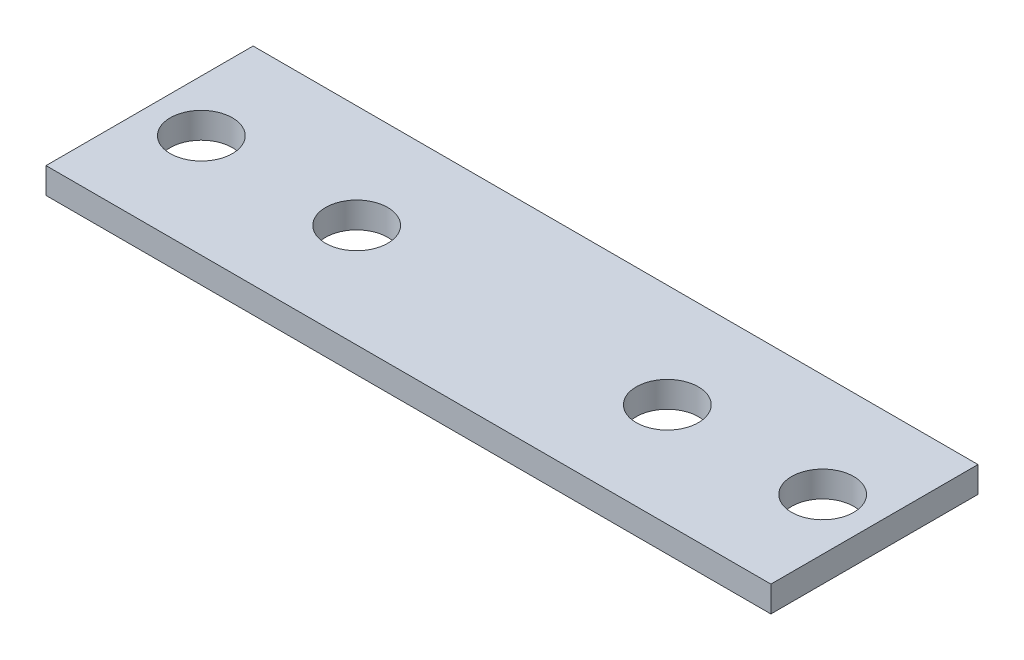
ISO-10303-21;
HEADER;
FILE_DESCRIPTION(('STEP AP214'),'2;1');
FILE_NAME('part.step','',(''),(''),'','','');
FILE_SCHEMA(('AUTOMOTIVE_DESIGN { 1 0 10303 214 1 1 1 1 }'));
ENDSEC;
DATA;
#1=APPLICATION_CONTEXT('core data for automotive mechanical design processes');
#2=APPLICATION_PROTOCOL_DEFINITION('international standard','automotive_design',2000,#1);
#3=PRODUCT_CONTEXT('',#1,'mechanical');
#4=PRODUCT('Part','Part','',(#3));
#5=PRODUCT_RELATED_PRODUCT_CATEGORY('part','',(#4));
#6=PRODUCT_DEFINITION_FORMATION('','',#4);
#7=PRODUCT_DEFINITION_CONTEXT('part definition',#1,'design');
#8=PRODUCT_DEFINITION('design','',#6,#7);
#9=PRODUCT_DEFINITION_SHAPE('','',#8);
#10=(LENGTH_UNIT() NAMED_UNIT(*) SI_UNIT(.MILLI.,.METRE.));
#11=(NAMED_UNIT(*) PLANE_ANGLE_UNIT() SI_UNIT($,.RADIAN.));
#12=(NAMED_UNIT(*) SI_UNIT($,.STERADIAN.) SOLID_ANGLE_UNIT());
#13=UNCERTAINTY_MEASURE_WITH_UNIT(LENGTH_MEASURE(1.E-05),#10,'distance_accuracy_value','');
#14=(GEOMETRIC_REPRESENTATION_CONTEXT(3) GLOBAL_UNCERTAINTY_ASSIGNED_CONTEXT((#13)) GLOBAL_UNIT_ASSIGNED_CONTEXT((#10,
#11,#12)) REPRESENTATION_CONTEXT('',''));
#15=CARTESIAN_POINT('',(0.,0.,0.));
#16=DIRECTION('',(0.,0.,1.));
#17=DIRECTION('',(1.,0.,0.));
#18=AXIS2_PLACEMENT_3D('',#15,#16,#17);
#19=CARTESIAN_POINT('',(0.,5.,-40.));
#20=DIRECTION('',(0.,-1.,0.));
#21=DIRECTION('',(0.,0.,-1.));
#22=AXIS2_PLACEMENT_3D('',#19,#20,#21);
#23=PLANE('',#22);
#24=CARTESIAN_POINT('',(40.,5.,-20.));
#25=DIRECTION('',(0.,1.,0.));
#26=DIRECTION('',(0.,0.,1.));
#27=AXIS2_PLACEMENT_3D('',#24,#25,#26);
#28=CIRCLE('',#27,6.00000000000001);
#29=CARTESIAN_POINT('',(40.,5.,-14.));
#30=VERTEX_POINT('',#29);
#31=EDGE_CURVE('E128',#30,#30,#28,.T.);
#32=ORIENTED_EDGE('',*,*,#31,.F.);
#33=EDGE_LOOP('',(#32));
#34=FACE_BOUND('',#33,.T.);
#35=CARTESIAN_POINT('',(10.,5.,-20.));
#36=DIRECTION('',(0.,1.,0.));
#37=DIRECTION('',(0.,0.,1.));
#38=AXIS2_PLACEMENT_3D('',#35,#36,#37);
#39=CIRCLE('',#38,6.);
#40=CARTESIAN_POINT('',(10.,5.,-14.));
#41=VERTEX_POINT('',#40);
#42=EDGE_CURVE('E90',#41,#41,#39,.T.);
#43=ORIENTED_EDGE('',*,*,#42,.F.);
#44=EDGE_LOOP('',(#43));
#45=FACE_BOUND('',#44,.T.);
#46=DIRECTION('',(0.,0.,1.));
#47=VECTOR('',#46,1.);
#48=CARTESIAN_POINT('',(0.,5.,0.));
#49=LINE('',#48,#47);
#50=CARTESIAN_POINT('',(0.,5.,-40.));
#51=VERTEX_POINT('',#50);
#52=CARTESIAN_POINT('',(0.,5.,0.));
#53=VERTEX_POINT('',#52);
#54=EDGE_CURVE('E100',#51,#53,#49,.T.);
#55=ORIENTED_EDGE('',*,*,#54,.T.);
#56=DIRECTION('',(1.,0.,0.));
#57=VECTOR('',#56,1.);
#58=CARTESIAN_POINT('',(0.,5.,0.));
#59=LINE('',#58,#57);
#60=CARTESIAN_POINT('',(140.,5.,0.));
#61=VERTEX_POINT('',#60);
#62=EDGE_CURVE('E85',#53,#61,#59,.T.);
#63=ORIENTED_EDGE('',*,*,#62,.T.);
#64=DIRECTION('',(0.,0.,-1.));
#65=VECTOR('',#64,1.);
#66=CARTESIAN_POINT('',(140.,5.,0.));
#67=LINE('',#66,#65);
#68=CARTESIAN_POINT('',(140.,5.,-40.));
#69=VERTEX_POINT('',#68);
#70=EDGE_CURVE('E51',#61,#69,#67,.T.);
#71=ORIENTED_EDGE('',*,*,#70,.T.);
#72=DIRECTION('',(-1.,0.,0.));
#73=VECTOR('',#72,1.);
#74=CARTESIAN_POINT('',(0.,5.,-40.));
#75=LINE('',#74,#73);
#76=EDGE_CURVE('E46',#69,#51,#75,.T.);
#77=ORIENTED_EDGE('',*,*,#76,.T.);
#78=EDGE_LOOP('',(#55,#63,#71,#77));
#79=FACE_BOUND('',#78,.T.);
#80=CARTESIAN_POINT('',(130.,5.,-20.));
#81=DIRECTION('',(0.,1.,0.));
#82=DIRECTION('',(0.,0.,1.));
#83=AXIS2_PLACEMENT_3D('',#80,#81,#82);
#84=CIRCLE('',#83,6.00000000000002);
#85=CARTESIAN_POINT('',(130.,5.,-14.));
#86=VERTEX_POINT('',#85);
#87=EDGE_CURVE('E119',#86,#86,#84,.T.);
#88=ORIENTED_EDGE('',*,*,#87,.F.);
#89=EDGE_LOOP('',(#88));
#90=FACE_BOUND('',#89,.T.);
#91=CARTESIAN_POINT('',(100.,5.,-20.));
#92=DIRECTION('',(0.,1.,0.));
#93=DIRECTION('',(0.,0.,1.));
#94=AXIS2_PLACEMENT_3D('',#91,#92,#93);
#95=CIRCLE('',#94,6.);
#96=CARTESIAN_POINT('',(100.,5.,-14.));
#97=VERTEX_POINT('',#96);
#98=EDGE_CURVE('E122',#97,#97,#95,.T.);
#99=ORIENTED_EDGE('',*,*,#98,.F.);
#100=EDGE_LOOP('',(#99));
#101=FACE_BOUND('',#100,.T.);
#102=ADVANCED_FACE('F31',(#34,#45,#79,#90,#101),#23,.F.);
#103=CARTESIAN_POINT('',(0.,0.,-40.));
#104=DIRECTION('',(0.,-1.,0.));
#105=DIRECTION('',(0.,0.,-1.));
#106=AXIS2_PLACEMENT_3D('',#103,#104,#105);
#107=PLANE('',#106);
#108=CARTESIAN_POINT('',(40.,0.,-20.));
#109=DIRECTION('',(0.,1.,0.));
#110=DIRECTION('',(0.,0.,1.));
#111=AXIS2_PLACEMENT_3D('',#108,#109,#110);
#112=CIRCLE('',#111,6.00000000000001);
#113=CARTESIAN_POINT('',(40.,0.,-14.));
#114=VERTEX_POINT('',#113);
#115=EDGE_CURVE('E124',#114,#114,#112,.T.);
#116=ORIENTED_EDGE('',*,*,#115,.T.);
#117=EDGE_LOOP('',(#116));
#118=FACE_BOUND('',#117,.T.);
#119=CARTESIAN_POINT('',(10.,0.,-20.));
#120=DIRECTION('',(0.,1.,0.));
#121=DIRECTION('',(0.,0.,1.));
#122=AXIS2_PLACEMENT_3D('',#119,#120,#121);
#123=CIRCLE('',#122,6.);
#124=CARTESIAN_POINT('',(10.,0.,-14.));
#125=VERTEX_POINT('',#124);
#126=EDGE_CURVE('E93',#125,#125,#123,.T.);
#127=ORIENTED_EDGE('',*,*,#126,.T.);
#128=EDGE_LOOP('',(#127));
#129=FACE_BOUND('',#128,.T.);
#130=DIRECTION('',(0.,0.,1.));
#131=VECTOR('',#130,1.);
#132=CARTESIAN_POINT('',(0.,0.,0.));
#133=LINE('',#132,#131);
#134=CARTESIAN_POINT('',(0.,0.,-40.));
#135=VERTEX_POINT('',#134);
#136=CARTESIAN_POINT('',(0.,0.,0.));
#137=VERTEX_POINT('',#136);
#138=EDGE_CURVE('E77',#135,#137,#133,.T.);
#139=ORIENTED_EDGE('',*,*,#138,.F.);
#140=DIRECTION('',(-1.,0.,0.));
#141=VECTOR('',#140,1.);
#142=CARTESIAN_POINT('',(0.,0.,-40.));
#143=LINE('',#142,#141);
#144=CARTESIAN_POINT('',(140.,0.,-40.));
#145=VERTEX_POINT('',#144);
#146=EDGE_CURVE('E98',#145,#135,#143,.T.);
#147=ORIENTED_EDGE('',*,*,#146,.F.);
#148=DIRECTION('',(0.,0.,-1.));
#149=VECTOR('',#148,1.);
#150=CARTESIAN_POINT('',(140.,0.,0.));
#151=LINE('',#150,#149);
#152=CARTESIAN_POINT('',(140.,0.,0.));
#153=VERTEX_POINT('',#152);
#154=EDGE_CURVE('E78',#153,#145,#151,.T.);
#155=ORIENTED_EDGE('',*,*,#154,.F.);
#156=DIRECTION('',(1.,0.,0.));
#157=VECTOR('',#156,1.);
#158=CARTESIAN_POINT('',(0.,0.,0.));
#159=LINE('',#158,#157);
#160=EDGE_CURVE('E72',#137,#153,#159,.T.);
#161=ORIENTED_EDGE('',*,*,#160,.F.);
#162=EDGE_LOOP('',(#139,#147,#155,#161));
#163=FACE_BOUND('',#162,.T.);
#164=CARTESIAN_POINT('',(130.,0.,-20.));
#165=DIRECTION('',(0.,1.,0.));
#166=DIRECTION('',(0.,0.,1.));
#167=AXIS2_PLACEMENT_3D('',#164,#165,#166);
#168=CIRCLE('',#167,6.00000000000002);
#169=CARTESIAN_POINT('',(130.,0.,-14.));
#170=VERTEX_POINT('',#169);
#171=EDGE_CURVE('E135',#170,#170,#168,.T.);
#172=ORIENTED_EDGE('',*,*,#171,.T.);
#173=EDGE_LOOP('',(#172));
#174=FACE_BOUND('',#173,.T.);
#175=CARTESIAN_POINT('',(100.,0.,-20.));
#176=DIRECTION('',(0.,1.,0.));
#177=DIRECTION('',(0.,0.,1.));
#178=AXIS2_PLACEMENT_3D('',#175,#176,#177);
#179=CIRCLE('',#178,6.);
#180=CARTESIAN_POINT('',(100.,0.,-14.));
#181=VERTEX_POINT('',#180);
#182=EDGE_CURVE('E125',#181,#181,#179,.T.);
#183=ORIENTED_EDGE('',*,*,#182,.T.);
#184=EDGE_LOOP('',(#183));
#185=FACE_BOUND('',#184,.T.);
#186=ADVANCED_FACE('F73',(#118,#129,#163,#174,#185),#107,.T.);
#187=CARTESIAN_POINT('',(0.,5.,0.));
#188=DIRECTION('',(1.,0.,0.));
#189=DIRECTION('',(0.,0.,-1.));
#190=AXIS2_PLACEMENT_3D('',#187,#188,#189);
#191=PLANE('',#190);
#192=ORIENTED_EDGE('',*,*,#138,.T.);
#193=DIRECTION('',(0.,-1.,0.));
#194=VECTOR('',#193,1.);
#195=CARTESIAN_POINT('',(0.,5.,0.));
#196=LINE('',#195,#194);
#197=EDGE_CURVE('E11',#53,#137,#196,.T.);
#198=ORIENTED_EDGE('',*,*,#197,.F.);
#199=ORIENTED_EDGE('',*,*,#54,.F.);
#200=DIRECTION('',(0.,-1.,0.));
#201=VECTOR('',#200,1.);
#202=CARTESIAN_POINT('',(0.,5.,-40.));
#203=LINE('',#202,#201);
#204=EDGE_CURVE('E89',#51,#135,#203,.T.);
#205=ORIENTED_EDGE('',*,*,#204,.T.);
#206=EDGE_LOOP('',(#192,#198,#199,#205));
#207=FACE_BOUND('',#206,.T.);
#208=ADVANCED_FACE('F33',(#207),#191,.F.);
#209=CARTESIAN_POINT('',(0.,5.,0.));
#210=DIRECTION('',(0.,0.,-1.));
#211=DIRECTION('',(-1.,0.,0.));
#212=AXIS2_PLACEMENT_3D('',#209,#210,#211);
#213=PLANE('',#212);
#214=ORIENTED_EDGE('',*,*,#160,.T.);
#215=DIRECTION('',(0.,-1.,0.));
#216=VECTOR('',#215,1.);
#217=CARTESIAN_POINT('',(140.,5.,0.));
#218=LINE('',#217,#216);
#219=EDGE_CURVE('E39',#61,#153,#218,.T.);
#220=ORIENTED_EDGE('',*,*,#219,.F.);
#221=ORIENTED_EDGE('',*,*,#62,.F.);
#222=ORIENTED_EDGE('',*,*,#197,.T.);
#223=EDGE_LOOP('',(#214,#220,#221,#222));
#224=FACE_BOUND('',#223,.T.);
#225=ADVANCED_FACE('F84',(#224),#213,.F.);
#226=CARTESIAN_POINT('',(140.,5.,0.));
#227=DIRECTION('',(-1.,0.,0.));
#228=DIRECTION('',(0.,0.,1.));
#229=AXIS2_PLACEMENT_3D('',#226,#227,#228);
#230=PLANE('',#229);
#231=ORIENTED_EDGE('',*,*,#154,.T.);
#232=DIRECTION('',(0.,-1.,0.));
#233=VECTOR('',#232,1.);
#234=CARTESIAN_POINT('',(140.,5.,-40.));
#235=LINE('',#234,#233);
#236=EDGE_CURVE('E106',#69,#145,#235,.T.);
#237=ORIENTED_EDGE('',*,*,#236,.F.);
#238=ORIENTED_EDGE('',*,*,#70,.F.);
#239=ORIENTED_EDGE('',*,*,#219,.T.);
#240=EDGE_LOOP('',(#231,#237,#238,#239));
#241=FACE_BOUND('',#240,.T.);
#242=ADVANCED_FACE('F109',(#241),#230,.F.);
#243=CARTESIAN_POINT('',(0.,5.,-40.));
#244=DIRECTION('',(0.,0.,1.));
#245=DIRECTION('',(1.,0.,0.));
#246=AXIS2_PLACEMENT_3D('',#243,#244,#245);
#247=PLANE('',#246);
#248=ORIENTED_EDGE('',*,*,#146,.T.);
#249=ORIENTED_EDGE('',*,*,#204,.F.);
#250=ORIENTED_EDGE('',*,*,#76,.F.);
#251=ORIENTED_EDGE('',*,*,#236,.T.);
#252=EDGE_LOOP('',(#248,#249,#250,#251));
#253=FACE_BOUND('',#252,.T.);
#254=ADVANCED_FACE('F111',(#253),#247,.F.);
#255=CARTESIAN_POINT('',(10.,5.,-20.));
#256=DIRECTION('',(0.,-1.,0.));
#257=DIRECTION('',(0.,0.,-1.));
#258=AXIS2_PLACEMENT_3D('',#255,#256,#257);
#259=CYLINDRICAL_SURFACE('',#258,6.);
#260=ORIENTED_EDGE('',*,*,#42,.T.);
#261=EDGE_LOOP('',(#260));
#262=FACE_BOUND('',#261,.T.);
#263=ORIENTED_EDGE('',*,*,#126,.F.);
#264=EDGE_LOOP('',(#263));
#265=FACE_BOUND('',#264,.T.);
#266=ADVANCED_FACE('F142',(#262,#265),#259,.F.);
#267=CARTESIAN_POINT('',(130.,5.,-20.));
#268=DIRECTION('',(0.,-1.,0.));
#269=DIRECTION('',(0.,0.,-1.));
#270=AXIS2_PLACEMENT_3D('',#267,#268,#269);
#271=CYLINDRICAL_SURFACE('',#270,6.00000000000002);
#272=ORIENTED_EDGE('',*,*,#87,.T.);
#273=EDGE_LOOP('',(#272));
#274=FACE_BOUND('',#273,.T.);
#275=ORIENTED_EDGE('',*,*,#171,.F.);
#276=EDGE_LOOP('',(#275));
#277=FACE_BOUND('',#276,.T.);
#278=ADVANCED_FACE('F144',(#274,#277),#271,.F.);
#279=CARTESIAN_POINT('',(40.,5.,-20.));
#280=DIRECTION('',(0.,-1.,0.));
#281=DIRECTION('',(0.,0.,-1.));
#282=AXIS2_PLACEMENT_3D('',#279,#280,#281);
#283=CYLINDRICAL_SURFACE('',#282,6.00000000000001);
#284=ORIENTED_EDGE('',*,*,#31,.T.);
#285=EDGE_LOOP('',(#284));
#286=FACE_BOUND('',#285,.T.);
#287=ORIENTED_EDGE('',*,*,#115,.F.);
#288=EDGE_LOOP('',(#287));
#289=FACE_BOUND('',#288,.T.);
#290=ADVANCED_FACE('F151',(#286,#289),#283,.F.);
#291=CARTESIAN_POINT('',(100.,5.,-20.));
#292=DIRECTION('',(0.,-1.,0.));
#293=DIRECTION('',(0.,0.,-1.));
#294=AXIS2_PLACEMENT_3D('',#291,#292,#293);
#295=CYLINDRICAL_SURFACE('',#294,6.);
#296=ORIENTED_EDGE('',*,*,#98,.T.);
#297=EDGE_LOOP('',(#296));
#298=FACE_BOUND('',#297,.T.);
#299=ORIENTED_EDGE('',*,*,#182,.F.);
#300=EDGE_LOOP('',(#299));
#301=FACE_BOUND('',#300,.T.);
#302=ADVANCED_FACE('F212',(#298,#301),#295,.F.);
#303=CLOSED_SHELL('',(#102,#186,#208,#225,#242,#254,#266,#278,#290,#302));
#304=MANIFOLD_SOLID_BREP('B2',#303);
#305=ADVANCED_BREP_SHAPE_REPRESENTATION('',(#18,#304),#14);
#306=SHAPE_DEFINITION_REPRESENTATION(#9,#305);
ENDSEC;
END-ISO-10303-21;
